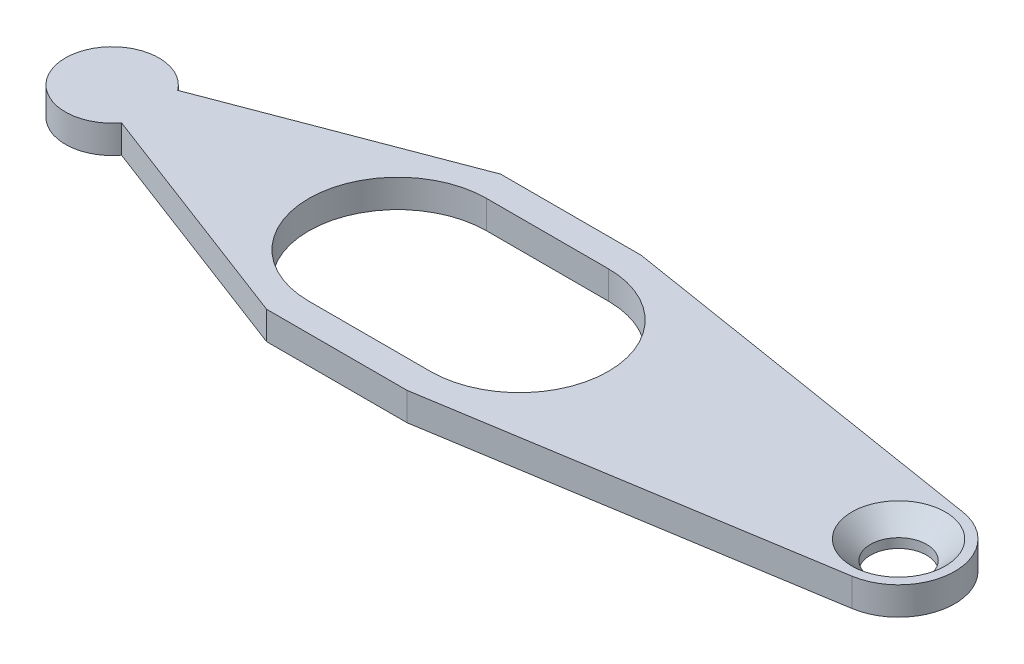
ISO-10303-21;
HEADER;
FILE_DESCRIPTION(('STEP AP214'),'2;1');
FILE_NAME('part.step','',(''),(''),'','','');
FILE_SCHEMA(('AUTOMOTIVE_DESIGN { 1 0 10303 214 1 1 1 1 }'));
ENDSEC;
DATA;
#1=APPLICATION_CONTEXT('core data for automotive mechanical design processes');
#2=APPLICATION_PROTOCOL_DEFINITION('international standard','automotive_design',2000,#1);
#3=PRODUCT_CONTEXT('',#1,'mechanical');
#4=PRODUCT('Part','Part','',(#3));
#5=PRODUCT_RELATED_PRODUCT_CATEGORY('part','',(#4));
#6=PRODUCT_DEFINITION_FORMATION('','',#4);
#7=PRODUCT_DEFINITION_CONTEXT('part definition',#1,'design');
#8=PRODUCT_DEFINITION('design','',#6,#7);
#9=PRODUCT_DEFINITION_SHAPE('','',#8);
#10=(LENGTH_UNIT() NAMED_UNIT(*) SI_UNIT(.MILLI.,.METRE.));
#11=(NAMED_UNIT(*) PLANE_ANGLE_UNIT() SI_UNIT($,.RADIAN.));
#12=(NAMED_UNIT(*) SI_UNIT($,.STERADIAN.) SOLID_ANGLE_UNIT());
#13=UNCERTAINTY_MEASURE_WITH_UNIT(LENGTH_MEASURE(1.E-05),#10,'distance_accuracy_value','');
#14=(GEOMETRIC_REPRESENTATION_CONTEXT(3) GLOBAL_UNCERTAINTY_ASSIGNED_CONTEXT((#13)) GLOBAL_UNIT_ASSIGNED_CONTEXT((#10,
#11,#12)) REPRESENTATION_CONTEXT('',''));
#15=CARTESIAN_POINT('',(0.,0.,0.));
#16=DIRECTION('',(0.,0.,1.));
#17=DIRECTION('',(1.,0.,0.));
#18=AXIS2_PLACEMENT_3D('',#15,#16,#17);
#19=CARTESIAN_POINT('',(0.,3.,0.));
#20=DIRECTION('',(0.,1.,0.));
#21=DIRECTION('',(0.,0.,1.));
#22=AXIS2_PLACEMENT_3D('',#19,#20,#21);
#23=PLANE('',#22);
#24=CARTESIAN_POINT('',(84.,3.,0.));
#25=DIRECTION('',(0.,1.,0.));
#26=DIRECTION('',(0.,0.,1.));
#27=AXIS2_PLACEMENT_3D('',#24,#25,#26);
#28=CIRCLE('',#27,5.);
#29=CARTESIAN_POINT('',(84.,3.,5.));
#30=VERTEX_POINT('',#29);
#31=EDGE_CURVE('E301',#30,#30,#28,.T.);
#32=ORIENTED_EDGE('',*,*,#31,.F.);
#33=EDGE_LOOP('',(#32));
#34=FACE_BOUND('',#33,.T.);
#35=CARTESIAN_POINT('',(0.,3.,0.));
#36=DIRECTION('',(0.,1.,0.));
#37=DIRECTION('',(0.,0.,1.));
#38=AXIS2_PLACEMENT_3D('',#35,#36,#37);
#39=CIRCLE('',#38,5.);
#40=CARTESIAN_POINT('',(4.,3.,-3.));
#41=VERTEX_POINT('',#40);
#42=CARTESIAN_POINT('',(4.,3.,3.));
#43=VERTEX_POINT('',#42);
#44=EDGE_CURVE('E158',#41,#43,#39,.T.);
#45=ORIENTED_EDGE('',*,*,#44,.T.);
#46=DIRECTION('',(0.934783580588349,0.,0.355217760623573));
#47=VECTOR('',#46,1.);
#48=CARTESIAN_POINT('',(4.,3.,3.));
#49=LINE('',#48,#47);
#50=CARTESIAN_POINT('',(29.,3.,12.5));
#51=VERTEX_POINT('',#50);
#52=EDGE_CURVE('E161',#43,#51,#49,.T.);
#53=ORIENTED_EDGE('',*,*,#52,.T.);
#54=DIRECTION('',(1.,0.,0.));
#55=VECTOR('',#54,1.);
#56=CARTESIAN_POINT('',(29.,3.,12.5));
#57=LINE('',#56,#55);
#58=CARTESIAN_POINT('',(44.,3.,12.5));
#59=VERTEX_POINT('',#58);
#60=EDGE_CURVE('E164',#51,#59,#57,.T.);
#61=ORIENTED_EDGE('',*,*,#60,.T.);
#62=DIRECTION('',(0.987351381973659,0.,-0.158547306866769));
#63=VECTOR('',#62,1.);
#64=CARTESIAN_POINT('',(44.,3.,12.5));
#65=LINE('',#64,#63);
#66=CARTESIAN_POINT('',(84.9512838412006,3.,5.92410829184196));
#67=VERTEX_POINT('',#66);
#68=EDGE_CURVE('E166',#59,#67,#65,.T.);
#69=ORIENTED_EDGE('',*,*,#68,.T.);
#70=CARTESIAN_POINT('',(84.,3.,0.));
#71=DIRECTION('',(0.,1.,0.));
#72=DIRECTION('',(0.,0.,1.));
#73=AXIS2_PLACEMENT_3D('',#70,#71,#72);
#74=CIRCLE('',#73,6.);
#75=CARTESIAN_POINT('',(84.9512838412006,3.,-5.92410829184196));
#76=VERTEX_POINT('',#75);
#77=EDGE_CURVE('E168',#67,#76,#74,.T.);
#78=ORIENTED_EDGE('',*,*,#77,.T.);
#79=DIRECTION('',(-0.987351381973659,0.,-0.158547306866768));
#80=VECTOR('',#79,1.);
#81=CARTESIAN_POINT('',(44.,3.,-12.5));
#82=LINE('',#81,#80);
#83=CARTESIAN_POINT('',(44.,3.,-12.5));
#84=VERTEX_POINT('',#83);
#85=EDGE_CURVE('E170',#76,#84,#82,.T.);
#86=ORIENTED_EDGE('',*,*,#85,.T.);
#87=DIRECTION('',(-1.,0.,0.));
#88=VECTOR('',#87,1.);
#89=CARTESIAN_POINT('',(29.,3.,-12.5));
#90=LINE('',#89,#88);
#91=CARTESIAN_POINT('',(29.,3.,-12.5));
#92=VERTEX_POINT('',#91);
#93=EDGE_CURVE('E172',#84,#92,#90,.T.);
#94=ORIENTED_EDGE('',*,*,#93,.T.);
#95=DIRECTION('',(-0.934783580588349,0.,0.355217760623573));
#96=VECTOR('',#95,1.);
#97=CARTESIAN_POINT('',(4.,3.,-3.));
#98=LINE('',#97,#96);
#99=EDGE_CURVE('E174',#92,#41,#98,.T.);
#100=ORIENTED_EDGE('',*,*,#99,.T.);
#101=EDGE_LOOP('',(#45,#53,#61,#69,#78,#86,#94,#100));
#102=FACE_BOUND('',#101,.T.);
#103=DIRECTION('',(1.,0.,0.));
#104=VECTOR('',#103,1.);
#105=CARTESIAN_POINT('',(43.5,3.,9.5));
#106=LINE('',#105,#104);
#107=CARTESIAN_POINT('',(30.5,3.,9.5));
#108=VERTEX_POINT('',#107);
#109=CARTESIAN_POINT('',(43.5,3.,9.5));
#110=VERTEX_POINT('',#109);
#111=EDGE_CURVE('E128',#108,#110,#106,.T.);
#112=ORIENTED_EDGE('',*,*,#111,.F.);
#113=CARTESIAN_POINT('',(30.5,3.,0.));
#114=DIRECTION('',(0.,1.,0.));
#115=DIRECTION('',(0.,0.,1.));
#116=AXIS2_PLACEMENT_3D('',#113,#114,#115);
#117=CIRCLE('',#116,9.5);
#118=CARTESIAN_POINT('',(30.5,3.,-9.5));
#119=VERTEX_POINT('',#118);
#120=EDGE_CURVE('E120',#119,#108,#117,.T.);
#121=ORIENTED_EDGE('',*,*,#120,.F.);
#122=DIRECTION('',(-1.,0.,0.));
#123=VECTOR('',#122,1.);
#124=CARTESIAN_POINT('',(30.5,3.,-9.5));
#125=LINE('',#124,#123);
#126=CARTESIAN_POINT('',(43.5,3.,-9.5));
#127=VERTEX_POINT('',#126);
#128=EDGE_CURVE('E142',#127,#119,#125,.T.);
#129=ORIENTED_EDGE('',*,*,#128,.F.);
#130=CARTESIAN_POINT('',(43.5,3.,0.));
#131=DIRECTION('',(0.,1.,0.));
#132=DIRECTION('',(0.,0.,1.));
#133=AXIS2_PLACEMENT_3D('',#130,#131,#132);
#134=CIRCLE('',#133,9.5);
#135=EDGE_CURVE('E140',#110,#127,#134,.T.);
#136=ORIENTED_EDGE('',*,*,#135,.F.);
#137=EDGE_LOOP('',(#112,#121,#129,#136));
#138=FACE_BOUND('',#137,.T.);
#139=ADVANCED_FACE('F31',(#34,#102,#138),#23,.T.);
#140=CARTESIAN_POINT('',(0.,0.,0.));
#141=DIRECTION('',(0.,1.,0.));
#142=DIRECTION('',(0.,0.,1.));
#143=AXIS2_PLACEMENT_3D('',#140,#141,#142);
#144=PLANE('',#143);
#145=CARTESIAN_POINT('',(84.,0.,0.));
#146=DIRECTION('',(0.,1.,0.));
#147=DIRECTION('',(0.,0.,1.));
#148=AXIS2_PLACEMENT_3D('',#145,#146,#147);
#149=CIRCLE('',#148,3.);
#150=CARTESIAN_POINT('',(84.,0.,3.));
#151=VERTEX_POINT('',#150);
#152=EDGE_CURVE('E148',#151,#151,#149,.T.);
#153=ORIENTED_EDGE('',*,*,#152,.T.);
#154=EDGE_LOOP('',(#153));
#155=FACE_BOUND('',#154,.T.);
#156=CARTESIAN_POINT('',(0.,0.,0.));
#157=DIRECTION('',(0.,1.,0.));
#158=DIRECTION('',(0.,0.,1.));
#159=AXIS2_PLACEMENT_3D('',#156,#157,#158);
#160=CIRCLE('',#159,5.);
#161=CARTESIAN_POINT('',(4.,0.,-3.));
#162=VERTEX_POINT('',#161);
#163=CARTESIAN_POINT('',(4.,0.,3.));
#164=VERTEX_POINT('',#163);
#165=EDGE_CURVE('E136',#162,#164,#160,.T.);
#166=ORIENTED_EDGE('',*,*,#165,.F.);
#167=DIRECTION('',(-0.934783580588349,0.,0.355217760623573));
#168=VECTOR('',#167,1.);
#169=CARTESIAN_POINT('',(4.,0.,-3.));
#170=LINE('',#169,#168);
#171=CARTESIAN_POINT('',(29.,0.,-12.5));
#172=VERTEX_POINT('',#171);
#173=EDGE_CURVE('E162',#172,#162,#170,.T.);
#174=ORIENTED_EDGE('',*,*,#173,.F.);
#175=DIRECTION('',(-1.,0.,0.));
#176=VECTOR('',#175,1.);
#177=CARTESIAN_POINT('',(29.,0.,-12.5));
#178=LINE('',#177,#176);
#179=CARTESIAN_POINT('',(44.,0.,-12.5));
#180=VERTEX_POINT('',#179);
#181=EDGE_CURVE('E189',#180,#172,#178,.T.);
#182=ORIENTED_EDGE('',*,*,#181,.F.);
#183=DIRECTION('',(-0.987351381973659,0.,-0.158547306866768));
#184=VECTOR('',#183,1.);
#185=CARTESIAN_POINT('',(44.,0.,-12.5));
#186=LINE('',#185,#184);
#187=CARTESIAN_POINT('',(84.9512838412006,0.,-5.92410829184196));
#188=VERTEX_POINT('',#187);
#189=EDGE_CURVE('E187',#188,#180,#186,.T.);
#190=ORIENTED_EDGE('',*,*,#189,.F.);
#191=CARTESIAN_POINT('',(84.,0.,0.));
#192=DIRECTION('',(0.,1.,0.));
#193=DIRECTION('',(0.,0.,1.));
#194=AXIS2_PLACEMENT_3D('',#191,#192,#193);
#195=CIRCLE('',#194,6.);
#196=CARTESIAN_POINT('',(84.9512838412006,0.,5.92410829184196));
#197=VERTEX_POINT('',#196);
#198=EDGE_CURVE('E185',#197,#188,#195,.T.);
#199=ORIENTED_EDGE('',*,*,#198,.F.);
#200=DIRECTION('',(0.987351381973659,0.,-0.158547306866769));
#201=VECTOR('',#200,1.);
#202=CARTESIAN_POINT('',(44.,0.,12.5));
#203=LINE('',#202,#201);
#204=CARTESIAN_POINT('',(44.,0.,12.5));
#205=VERTEX_POINT('',#204);
#206=EDGE_CURVE('E183',#205,#197,#203,.T.);
#207=ORIENTED_EDGE('',*,*,#206,.F.);
#208=DIRECTION('',(1.,0.,0.));
#209=VECTOR('',#208,1.);
#210=CARTESIAN_POINT('',(29.,0.,12.5));
#211=LINE('',#210,#209);
#212=CARTESIAN_POINT('',(29.,0.,12.5));
#213=VERTEX_POINT('',#212);
#214=EDGE_CURVE('E181',#213,#205,#211,.T.);
#215=ORIENTED_EDGE('',*,*,#214,.F.);
#216=DIRECTION('',(0.934783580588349,0.,0.355217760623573));
#217=VECTOR('',#216,1.);
#218=CARTESIAN_POINT('',(4.,0.,3.));
#219=LINE('',#218,#217);
#220=EDGE_CURVE('E179',#164,#213,#219,.T.);
#221=ORIENTED_EDGE('',*,*,#220,.F.);
#222=EDGE_LOOP('',(#166,#174,#182,#190,#199,#207,#215,#221));
#223=FACE_BOUND('',#222,.T.);
#224=CARTESIAN_POINT('',(30.5,0.,0.));
#225=DIRECTION('',(0.,1.,0.));
#226=DIRECTION('',(0.,0.,1.));
#227=AXIS2_PLACEMENT_3D('',#224,#225,#226);
#228=CIRCLE('',#227,9.5);
#229=CARTESIAN_POINT('',(30.5,0.,-9.5));
#230=VERTEX_POINT('',#229);
#231=CARTESIAN_POINT('',(30.5,0.,9.5));
#232=VERTEX_POINT('',#231);
#233=EDGE_CURVE('E54',#230,#232,#228,.T.);
#234=ORIENTED_EDGE('',*,*,#233,.T.);
#235=DIRECTION('',(1.,0.,0.));
#236=VECTOR('',#235,1.);
#237=CARTESIAN_POINT('',(43.5,0.,9.5));
#238=LINE('',#237,#236);
#239=CARTESIAN_POINT('',(43.5,0.,9.5));
#240=VERTEX_POINT('',#239);
#241=EDGE_CURVE('E135',#232,#240,#238,.T.);
#242=ORIENTED_EDGE('',*,*,#241,.T.);
#243=CARTESIAN_POINT('',(43.5,0.,0.));
#244=DIRECTION('',(0.,1.,0.));
#245=DIRECTION('',(0.,0.,1.));
#246=AXIS2_PLACEMENT_3D('',#243,#244,#245);
#247=CIRCLE('',#246,9.5);
#248=CARTESIAN_POINT('',(43.5,0.,-9.5));
#249=VERTEX_POINT('',#248);
#250=EDGE_CURVE('E150',#240,#249,#247,.T.);
#251=ORIENTED_EDGE('',*,*,#250,.T.);
#252=DIRECTION('',(-1.,0.,0.));
#253=VECTOR('',#252,1.);
#254=CARTESIAN_POINT('',(30.5,0.,-9.5));
#255=LINE('',#254,#253);
#256=EDGE_CURVE('E129',#249,#230,#255,.T.);
#257=ORIENTED_EDGE('',*,*,#256,.T.);
#258=EDGE_LOOP('',(#234,#242,#251,#257));
#259=FACE_BOUND('',#258,.T.);
#260=ADVANCED_FACE('F219',(#155,#223,#259),#144,.F.);
#261=CARTESIAN_POINT('',(0.,3.,0.));
#262=DIRECTION('',(0.,-1.,0.));
#263=DIRECTION('',(0.,0.,-1.));
#264=AXIS2_PLACEMENT_3D('',#261,#262,#263);
#265=CYLINDRICAL_SURFACE('',#264,5.);
#266=ORIENTED_EDGE('',*,*,#165,.T.);
#267=DIRECTION('',(0.,-1.,0.));
#268=VECTOR('',#267,1.);
#269=CARTESIAN_POINT('',(4.,3.,3.));
#270=LINE('',#269,#268);
#271=EDGE_CURVE('E11',#43,#164,#270,.T.);
#272=ORIENTED_EDGE('',*,*,#271,.F.);
#273=ORIENTED_EDGE('',*,*,#44,.F.);
#274=DIRECTION('',(0.,-1.,0.));
#275=VECTOR('',#274,1.);
#276=CARTESIAN_POINT('',(4.,3.,-3.));
#277=LINE('',#276,#275);
#278=EDGE_CURVE('E176',#41,#162,#277,.T.);
#279=ORIENTED_EDGE('',*,*,#278,.T.);
#280=EDGE_LOOP('',(#266,#272,#273,#279));
#281=FACE_BOUND('',#280,.T.);
#282=ADVANCED_FACE('F33',(#281),#265,.T.);
#283=CARTESIAN_POINT('',(4.,3.,3.));
#284=DIRECTION('',(0.355217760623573,0.,-0.934783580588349));
#285=DIRECTION('',(-0.934783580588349,0.,-0.355217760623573));
#286=AXIS2_PLACEMENT_3D('',#283,#284,#285);
#287=PLANE('',#286);
#288=ORIENTED_EDGE('',*,*,#220,.T.);
#289=DIRECTION('',(0.,-1.,0.));
#290=VECTOR('',#289,1.);
#291=CARTESIAN_POINT('',(29.,3.,12.5));
#292=LINE('',#291,#290);
#293=EDGE_CURVE('E39',#51,#213,#292,.T.);
#294=ORIENTED_EDGE('',*,*,#293,.F.);
#295=ORIENTED_EDGE('',*,*,#52,.F.);
#296=ORIENTED_EDGE('',*,*,#271,.T.);
#297=EDGE_LOOP('',(#288,#294,#295,#296));
#298=FACE_BOUND('',#297,.T.);
#299=ADVANCED_FACE('F236',(#298),#287,.F.);
#300=CARTESIAN_POINT('',(29.,3.,12.5));
#301=DIRECTION('',(0.,0.,-1.));
#302=DIRECTION('',(-1.,0.,0.));
#303=AXIS2_PLACEMENT_3D('',#300,#301,#302);
#304=PLANE('',#303);
#305=ORIENTED_EDGE('',*,*,#214,.T.);
#306=DIRECTION('',(0.,-1.,0.));
#307=VECTOR('',#306,1.);
#308=CARTESIAN_POINT('',(44.,3.,12.5));
#309=LINE('',#308,#307);
#310=EDGE_CURVE('E206',#59,#205,#309,.T.);
#311=ORIENTED_EDGE('',*,*,#310,.F.);
#312=ORIENTED_EDGE('',*,*,#60,.F.);
#313=ORIENTED_EDGE('',*,*,#293,.T.);
#314=EDGE_LOOP('',(#305,#311,#312,#313));
#315=FACE_BOUND('',#314,.T.);
#316=ADVANCED_FACE('F213',(#315),#304,.F.);
#317=CARTESIAN_POINT('',(44.,3.,12.5));
#318=DIRECTION('',(-0.158547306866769,0.,-0.987351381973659));
#319=DIRECTION('',(-0.987351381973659,0.,0.158547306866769));
#320=AXIS2_PLACEMENT_3D('',#317,#318,#319);
#321=PLANE('',#320);
#322=ORIENTED_EDGE('',*,*,#206,.T.);
#323=DIRECTION('',(0.,-1.,0.));
#324=VECTOR('',#323,1.);
#325=CARTESIAN_POINT('',(84.9512838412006,3.,5.92410829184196));
#326=LINE('',#325,#324);
#327=EDGE_CURVE('E203',#67,#197,#326,.T.);
#328=ORIENTED_EDGE('',*,*,#327,.F.);
#329=ORIENTED_EDGE('',*,*,#68,.F.);
#330=ORIENTED_EDGE('',*,*,#310,.T.);
#331=EDGE_LOOP('',(#322,#328,#329,#330));
#332=FACE_BOUND('',#331,.T.);
#333=ADVANCED_FACE('F225',(#332),#321,.F.);
#334=CARTESIAN_POINT('',(84.,3.,0.));
#335=DIRECTION('',(0.,-1.,0.));
#336=DIRECTION('',(0.,0.,-1.));
#337=AXIS2_PLACEMENT_3D('',#334,#335,#336);
#338=CYLINDRICAL_SURFACE('',#337,6.);
#339=ORIENTED_EDGE('',*,*,#198,.T.);
#340=DIRECTION('',(0.,-1.,0.));
#341=VECTOR('',#340,1.);
#342=CARTESIAN_POINT('',(84.9512838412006,3.,-5.92410829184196));
#343=LINE('',#342,#341);
#344=EDGE_CURVE('E200',#76,#188,#343,.T.);
#345=ORIENTED_EDGE('',*,*,#344,.F.);
#346=ORIENTED_EDGE('',*,*,#77,.F.);
#347=ORIENTED_EDGE('',*,*,#327,.T.);
#348=EDGE_LOOP('',(#339,#345,#346,#347));
#349=FACE_BOUND('',#348,.T.);
#350=ADVANCED_FACE('F229',(#349),#338,.T.);
#351=CARTESIAN_POINT('',(44.,3.,-12.5));
#352=DIRECTION('',(-0.158547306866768,0.,0.987351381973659));
#353=DIRECTION('',(0.987351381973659,0.,0.158547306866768));
#354=AXIS2_PLACEMENT_3D('',#351,#352,#353);
#355=PLANE('',#354);
#356=ORIENTED_EDGE('',*,*,#189,.T.);
#357=DIRECTION('',(0.,-1.,0.));
#358=VECTOR('',#357,1.);
#359=CARTESIAN_POINT('',(44.,3.,-12.5));
#360=LINE('',#359,#358);
#361=EDGE_CURVE('E197',#84,#180,#360,.T.);
#362=ORIENTED_EDGE('',*,*,#361,.F.);
#363=ORIENTED_EDGE('',*,*,#85,.F.);
#364=ORIENTED_EDGE('',*,*,#344,.T.);
#365=EDGE_LOOP('',(#356,#362,#363,#364));
#366=FACE_BOUND('',#365,.T.);
#367=ADVANCED_FACE('F249',(#366),#355,.F.);
#368=CARTESIAN_POINT('',(29.,3.,-12.5));
#369=DIRECTION('',(0.,0.,1.));
#370=DIRECTION('',(1.,0.,0.));
#371=AXIS2_PLACEMENT_3D('',#368,#369,#370);
#372=PLANE('',#371);
#373=ORIENTED_EDGE('',*,*,#181,.T.);
#374=DIRECTION('',(0.,-1.,0.));
#375=VECTOR('',#374,1.);
#376=CARTESIAN_POINT('',(29.,3.,-12.5));
#377=LINE('',#376,#375);
#378=EDGE_CURVE('E194',#92,#172,#377,.T.);
#379=ORIENTED_EDGE('',*,*,#378,.F.);
#380=ORIENTED_EDGE('',*,*,#93,.F.);
#381=ORIENTED_EDGE('',*,*,#361,.T.);
#382=EDGE_LOOP('',(#373,#379,#380,#381));
#383=FACE_BOUND('',#382,.T.);
#384=ADVANCED_FACE('F247',(#383),#372,.F.);
#385=CARTESIAN_POINT('',(4.,3.,-3.));
#386=DIRECTION('',(0.355217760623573,0.,0.934783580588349));
#387=DIRECTION('',(0.934783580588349,0.,-0.355217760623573));
#388=AXIS2_PLACEMENT_3D('',#385,#386,#387);
#389=PLANE('',#388);
#390=ORIENTED_EDGE('',*,*,#173,.T.);
#391=ORIENTED_EDGE('',*,*,#278,.F.);
#392=ORIENTED_EDGE('',*,*,#99,.F.);
#393=ORIENTED_EDGE('',*,*,#378,.T.);
#394=EDGE_LOOP('',(#390,#391,#392,#393));
#395=FACE_BOUND('',#394,.T.);
#396=ADVANCED_FACE('F242',(#395),#389,.F.);
#397=CARTESIAN_POINT('',(30.5,3.,0.));
#398=DIRECTION('',(0.,-1.,0.));
#399=DIRECTION('',(0.,0.,-1.));
#400=AXIS2_PLACEMENT_3D('',#397,#398,#399);
#401=CYLINDRICAL_SURFACE('',#400,9.5);
#402=ORIENTED_EDGE('',*,*,#233,.F.);
#403=DIRECTION('',(0.,-1.,0.));
#404=VECTOR('',#403,1.);
#405=CARTESIAN_POINT('',(30.5,3.,-9.5));
#406=LINE('',#405,#404);
#407=EDGE_CURVE('E124',#119,#230,#406,.T.);
#408=ORIENTED_EDGE('',*,*,#407,.F.);
#409=ORIENTED_EDGE('',*,*,#120,.T.);
#410=DIRECTION('',(0.,-1.,0.));
#411=VECTOR('',#410,1.);
#412=CARTESIAN_POINT('',(30.5,3.,9.5));
#413=LINE('',#412,#411);
#414=EDGE_CURVE('E123',#108,#232,#413,.T.);
#415=ORIENTED_EDGE('',*,*,#414,.T.);
#416=EDGE_LOOP('',(#402,#408,#409,#415));
#417=FACE_BOUND('',#416,.T.);
#418=ADVANCED_FACE('F122',(#417),#401,.F.);
#419=CARTESIAN_POINT('',(43.5,3.,9.5));
#420=DIRECTION('',(0.,0.,-1.));
#421=DIRECTION('',(-1.,0.,0.));
#422=AXIS2_PLACEMENT_3D('',#419,#420,#421);
#423=PLANE('',#422);
#424=ORIENTED_EDGE('',*,*,#241,.F.);
#425=ORIENTED_EDGE('',*,*,#414,.F.);
#426=ORIENTED_EDGE('',*,*,#111,.T.);
#427=DIRECTION('',(0.,-1.,0.));
#428=VECTOR('',#427,1.);
#429=CARTESIAN_POINT('',(43.5,3.,9.5));
#430=LINE('',#429,#428);
#431=EDGE_CURVE('E137',#110,#240,#430,.T.);
#432=ORIENTED_EDGE('',*,*,#431,.T.);
#433=EDGE_LOOP('',(#424,#425,#426,#432));
#434=FACE_BOUND('',#433,.T.);
#435=ADVANCED_FACE('F132',(#434),#423,.T.);
#436=CARTESIAN_POINT('',(43.5,3.,0.));
#437=DIRECTION('',(0.,-1.,0.));
#438=DIRECTION('',(0.,0.,-1.));
#439=AXIS2_PLACEMENT_3D('',#436,#437,#438);
#440=CYLINDRICAL_SURFACE('',#439,9.5);
#441=ORIENTED_EDGE('',*,*,#250,.F.);
#442=ORIENTED_EDGE('',*,*,#431,.F.);
#443=ORIENTED_EDGE('',*,*,#135,.T.);
#444=DIRECTION('',(0.,-1.,0.));
#445=VECTOR('',#444,1.);
#446=CARTESIAN_POINT('',(43.5,3.,-9.5));
#447=LINE('',#446,#445);
#448=EDGE_CURVE('E46',#127,#249,#447,.T.);
#449=ORIENTED_EDGE('',*,*,#448,.T.);
#450=EDGE_LOOP('',(#441,#442,#443,#449));
#451=FACE_BOUND('',#450,.T.);
#452=ADVANCED_FACE('F277',(#451),#440,.F.);
#453=CARTESIAN_POINT('',(30.5,3.,-9.5));
#454=DIRECTION('',(0.,0.,1.));
#455=DIRECTION('',(1.,0.,0.));
#456=AXIS2_PLACEMENT_3D('',#453,#454,#455);
#457=PLANE('',#456);
#458=ORIENTED_EDGE('',*,*,#256,.F.);
#459=ORIENTED_EDGE('',*,*,#448,.F.);
#460=ORIENTED_EDGE('',*,*,#128,.T.);
#461=ORIENTED_EDGE('',*,*,#407,.T.);
#462=EDGE_LOOP('',(#458,#459,#460,#461));
#463=FACE_BOUND('',#462,.T.);
#464=ADVANCED_FACE('F281',(#463),#457,.T.);
#465=CARTESIAN_POINT('',(84.,3.,0.));
#466=DIRECTION('',(0.,1.,0.));
#467=DIRECTION('',(0.,0.,1.));
#468=AXIS2_PLACEMENT_3D('',#465,#466,#467);
#469=CYLINDRICAL_SURFACE('',#468,3.);
#470=ORIENTED_EDGE('',*,*,#152,.F.);
#471=EDGE_LOOP('',(#470));
#472=FACE_BOUND('',#471,.T.);
#473=CARTESIAN_POINT('',(84.,1.,0.));
#474=DIRECTION('',(0.,1.,0.));
#475=DIRECTION('',(0.,0.,1.));
#476=AXIS2_PLACEMENT_3D('',#473,#474,#475);
#477=CIRCLE('',#476,3.);
#478=CARTESIAN_POINT('',(84.,1.,3.));
#479=VERTEX_POINT('',#478);
#480=EDGE_CURVE('E299',#479,#479,#477,.T.);
#481=ORIENTED_EDGE('',*,*,#480,.T.);
#482=EDGE_LOOP('',(#481));
#483=FACE_BOUND('',#482,.T.);
#484=ADVANCED_FACE('F287',(#472,#483),#469,.F.);
#485=CARTESIAN_POINT('',(84.,3.,0.));
#486=DIRECTION('',(0.,1.,0.));
#487=DIRECTION('',(0.,0.,1.));
#488=AXIS2_PLACEMENT_3D('',#485,#486,#487);
#489=CONICAL_SURFACE('',#488,5.,0.785398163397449);
#490=ORIENTED_EDGE('',*,*,#480,.F.);
#491=EDGE_LOOP('',(#490));
#492=FACE_BOUND('',#491,.T.);
#493=ORIENTED_EDGE('',*,*,#31,.T.);
#494=EDGE_LOOP('',(#493));
#495=FACE_BOUND('',#494,.T.);
#496=ADVANCED_FACE('F290',(#492,#495),#489,.F.);
#497=CLOSED_SHELL('',(#139,#260,#282,#299,#316,#333,#350,#367,#384,#396,#418,#435,#452,#464,
#484,#496));
#498=MANIFOLD_SOLID_BREP('B2',#497);
#499=ADVANCED_BREP_SHAPE_REPRESENTATION('',(#18,#498),#14);
#500=SHAPE_DEFINITION_REPRESENTATION(#9,#499);
ENDSEC;
END-ISO-10303-21;
